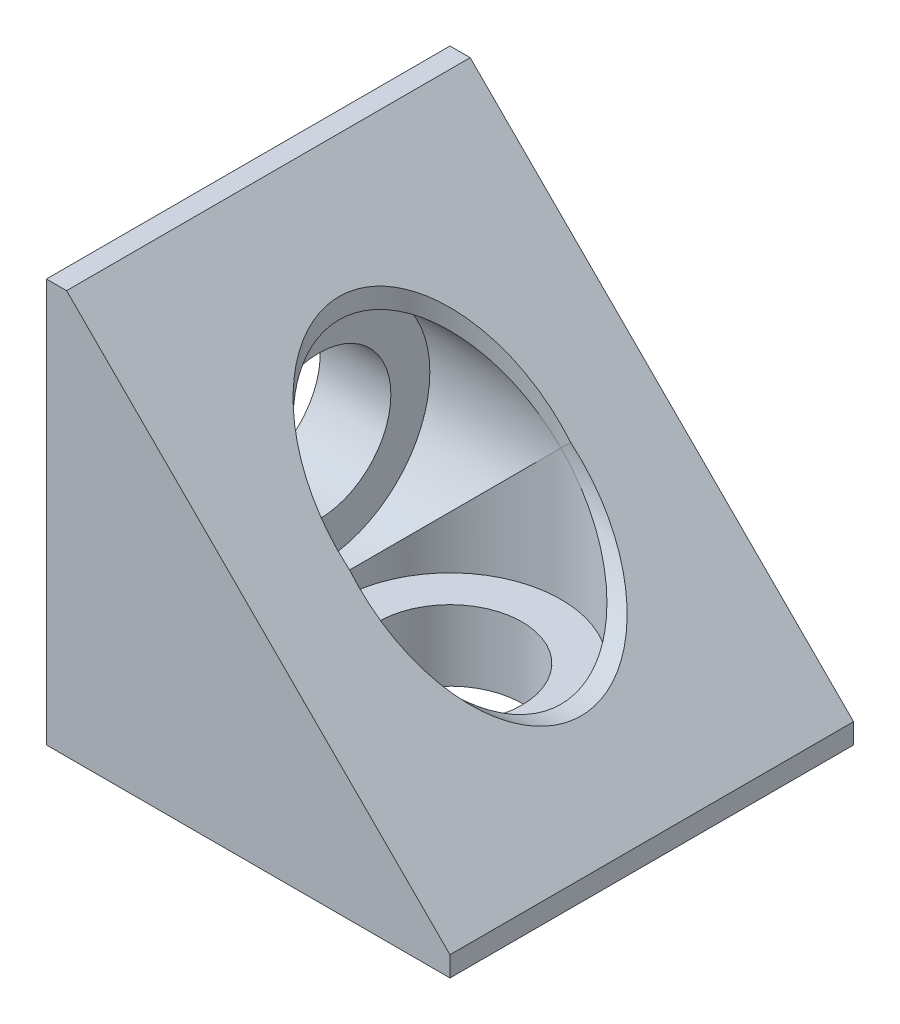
from build123d import *

# Parameters (mm, degrees)
EXTRUSION1_DEPTH = 20
SKETCH2_R        = 3.57
EXTRUSION2_DEPTH = 35.641016
SKETCH3_R        = 3.57
EXTRUSION3_DEPTH = 35.641016
EXTRUSION4_START = -16.5
SKETCH4_R        = 5.5
SKETCH4_R_2      = 3.57
EXTRUSION4_DEPTH = 16.5
SKETCH5_R        = 5.5
EXTRUSION5_DEPTH = 16.5


with BuildPart() as part:
    # Sketch1 → Extrusion1 (new body)
    with BuildSketch(Plane.XY):
        Polygon((0, 0), (0, 20), (1, 20), (20, 1.000082), (20, 0), align=None)
    extrude(amount=EXTRUSION1_DEPTH)

    # Sketch2 → Extrusion2 (cut, through all)
    with BuildSketch(Plane.ZY):
        with Locations((10, 10)):
            Circle(SKETCH2_R)
    extrude(amount=-EXTRUSION2_DEPTH, mode=Mode.SUBTRACT)

    # Sketch3 → Extrusion3 (cut, through all)
    with BuildSketch(Plane.XZ):
        with Locations((10, 10)):
            Circle(SKETCH3_R)
    extrude(amount=-EXTRUSION3_DEPTH, mode=Mode.SUBTRACT)

    # Sketch4 → Extrusion4 (cut)
    with BuildSketch(Plane(origin=(20, 0, 0), x_dir=(0, 0, -1), z_dir=(1, 0, 0)).offset(EXTRUSION4_START)):
        with Locations((-10, 10)):
            Circle(SKETCH4_R)
        with Locations(Location((-10, 10, 0), (0, 0, 180))):
            Circle(SKETCH4_R_2, mode=Mode.SUBTRACT)
    extrude(amount=EXTRUSION4_DEPTH, mode=Mode.SUBTRACT)

    # Sketch5 → Extrusion5 (cut)
    with BuildSketch(Plane(origin=(0, 20, 0), x_dir=(-1, 0, 0), z_dir=(0, 1, 0))):
        with Locations(Location((-10, 10, 0), (0, 0, 90))):
            Circle(SKETCH5_R)
    extrude(amount=-EXTRUSION5_DEPTH, mode=Mode.SUBTRACT)


solid = part.part
